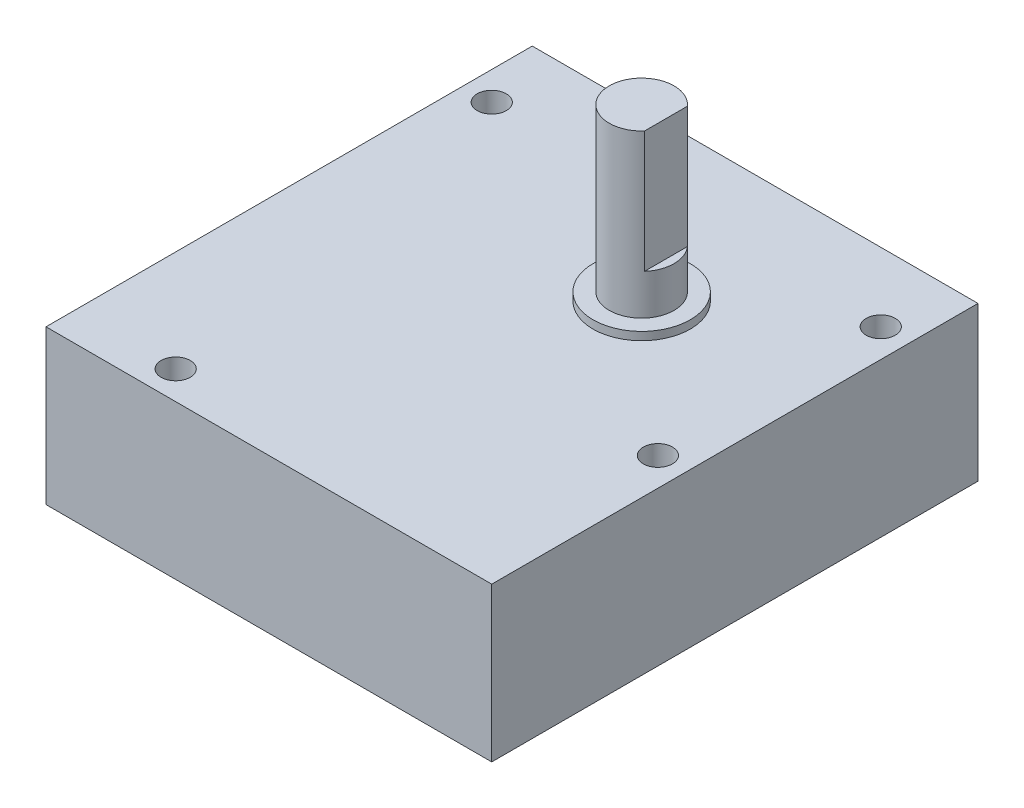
from build123d import *

# Parameters (mm, degrees)
SKETCH2_W               = 55
SKETCH2_H               = 60
BOSS_EXTRUDE1_DEPTH     = 19
CUT_EXTRUDE1_DEPTH      = 45.913806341
CUT_EXTRUDE1_DEPTH_BACK = 45.913806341
SKETCH3_R               = 1.8
SKETCH4_R               = 4
BOSS_EXTRUDE2_DEPTH     = 21
CUT_EXTRUDE2_START      = -15
CUT_EXTRUDE2_DEPTH      = 15
SKETCH6_R               = 6
BOSS_EXTRUDE3_DEPTH     = 1


with BuildPart() as part:
    # Sketch2 → Boss-Extrude1 (new body)
    with BuildSketch(Plane(origin=(0, 0, 0), x_dir=(1, 0, 0), z_dir=(0, 1, 0))):
        Rectangle(SKETCH2_W, SKETCH2_H)
    extrude(amount=BOSS_EXTRUDE1_DEPTH)

    # Sketch3 → Cut-Extrude1 (cut, two sides: drawn at the far end of the back side and taken through both)
    with BuildSketch(Plane(origin=(0, 19, 0), x_dir=(1, 0, 0), z_dir=(0, 1, 0)).offset(-CUT_EXTRUDE1_DEPTH_BACK)):
        with Locations(Location((-15, -26.5, 0), (0, 0, 270))):
            Circle(SKETCH3_R)
        with Locations(Location((-24, 21.5, 0), (0, 0, 270))):
            Circle(SKETCH3_R)
        with Locations(Location((24, 21.5, 0), (0, 0, 270))):
            Circle(SKETCH3_R)
        with Locations(Location((24, -6, 0), (0, 0, 270))):
            Circle(SKETCH3_R)
    extrude(amount=CUT_EXTRUDE1_DEPTH + CUT_EXTRUDE1_DEPTH_BACK, mode=Mode.SUBTRACT)

    # Sketch4 → Boss-Extrude2 (add)
    with BuildSketch(Plane(origin=(0, 19, 0), x_dir=(1, 0, 0), z_dir=(0, 1, 0))):
        with Locations(Location((6.5, 9.5, 0), (0, 0, 90))):
            Circle(SKETCH4_R)
    extrude(amount=BOSS_EXTRUDE2_DEPTH)

    # Sketch5 → Cut-Extrude2 (cut)
    with BuildSketch(Plane(origin=(0, 40, 0), x_dir=(1, 0, 0), z_dir=(0, 1, 0)).offset(CUT_EXTRUDE2_START)):
        with BuildLine():
            Line((9.5, 12.145751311), (9.5, 6.854248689))
            ThreePointArc((9.5, 6.854248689), (10.5, 9.5), (9.5, 12.145751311))
        make_face()
    extrude(amount=CUT_EXTRUDE2_DEPTH, mode=Mode.SUBTRACT)

    # Sketch6 → Boss-Extrude3 (add)
    with BuildSketch(Plane(origin=(0, 19, 0), x_dir=(1, 0, 0), z_dir=(0, 1, 0))):
        with Locations(Location((6.5, 9.5, 0), (0, 0, 270))):
            Circle(SKETCH6_R)
    extrude(amount=BOSS_EXTRUDE3_DEPTH)


solid = part.part
